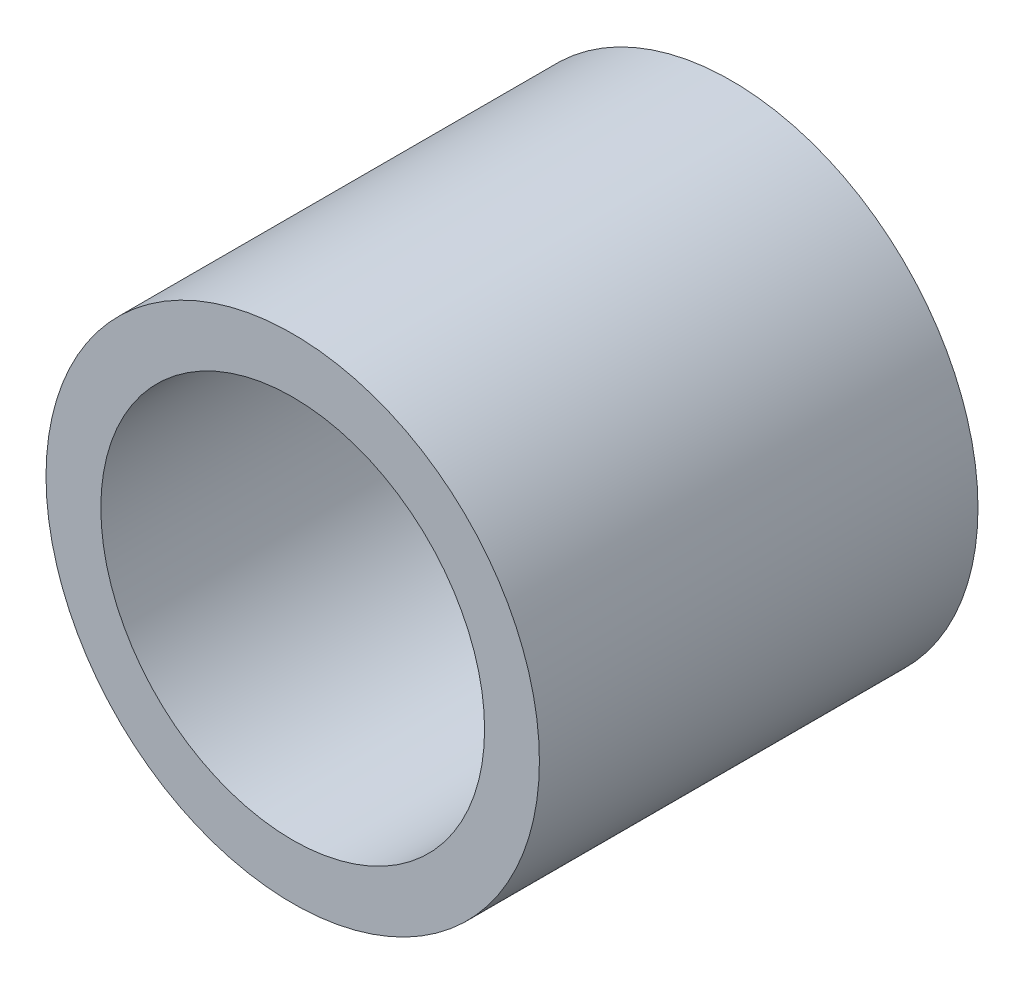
from build123d import *

# Parameters (mm, degrees)
ESQUISSE1_R      = 4.5
ESQUISSE1_R_2    = 3.5
EXTRUSION1_DEPTH = 8


with BuildPart() as part:
    # Esquisse1 → Extrusion1 (new body)
    with BuildSketch(Plane.XY):
        Circle(ESQUISSE1_R)
        Circle(ESQUISSE1_R_2, mode=Mode.SUBTRACT)
    extrude(amount=EXTRUSION1_DEPTH)


solid = part.part
